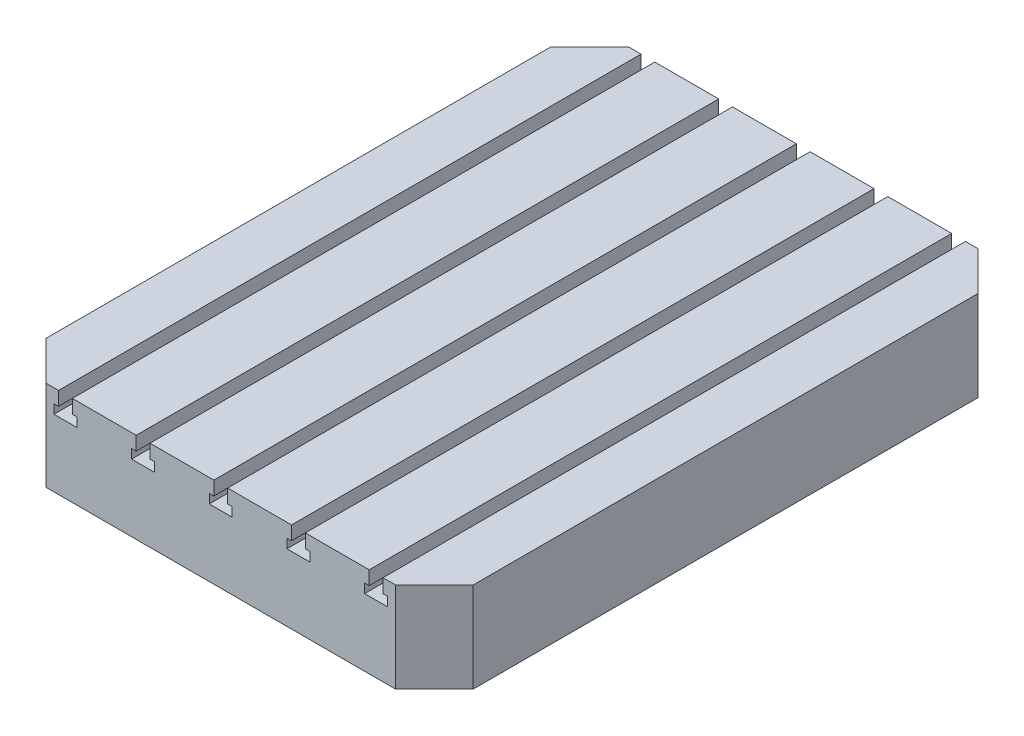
from build123d import *

# Parameters (mm, degrees)
SKETCH1_W          = 558.8
SKETCH1_H          = 762
BASE_EXTRUDE_DEPTH = 118
CUT_EXTRUDE1_DEPTH = 821.141670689
CHAMFER1_SIZE      = 50.8


with BuildPart() as part:
    # Sketch1 → Base-Extrude (new body)
    with BuildSketch(Plane(origin=(0, 0, 0), x_dir=(1, 0, 0), z_dir=(0, 1, 0))):
        Rectangle(SKETCH1_W, SKETCH1_H)
    extrude(amount=-BASE_EXTRUDE_DEPTH)

    # Sketch2 → Cut-Extrude1 (cut, through all)
    with BuildSketch(Plane.XY.offset(381)):
        Polygon((-212.2, 0), (-194.2, 0), (-194.2, -18), (-188.2, -18), (-188.2, -30), (-218.2, -30), (-218.2, -18), (-212.2, -18), align=None)
        Polygon((-110.6, 0), (-92.6, 0), (-92.6, -18), (-86.6, -18), (-86.6, -30), (-116.6, -30), (-116.6, -18), (-110.6, -18), align=None)
        Polygon((-9, 0), (9, 0), (9, -18), (15, -18), (15, -30), (-15, -30), (-15, -18), (-9, -18), align=None)
        Polygon((92.6, 0), (110.6, 0), (110.6, -18), (116.6, -18), (116.6, -30), (86.6, -30), (86.6, -18), (92.6, -18), align=None)
        Polygon((194.2, 0), (212.2, 0), (212.2, -18), (218.2, -18), (218.2, -30), (188.2, -30), (188.2, -18), (194.2, -18), align=None)
    extrude(amount=-CUT_EXTRUDE1_DEPTH, mode=Mode.SUBTRACT)

    # Chamfer1
    chamfer1_edges = [part.edges().sort_by_distance(p)[0] for p in [
        (-279.4, -59, -381),
        (279.4, -59, -381),
        (279.4, -59, 381),
        (-279.4, -59, 381),
    ]]
    chamfer(chamfer1_edges, length=CHAMFER1_SIZE)


solid = part.part
